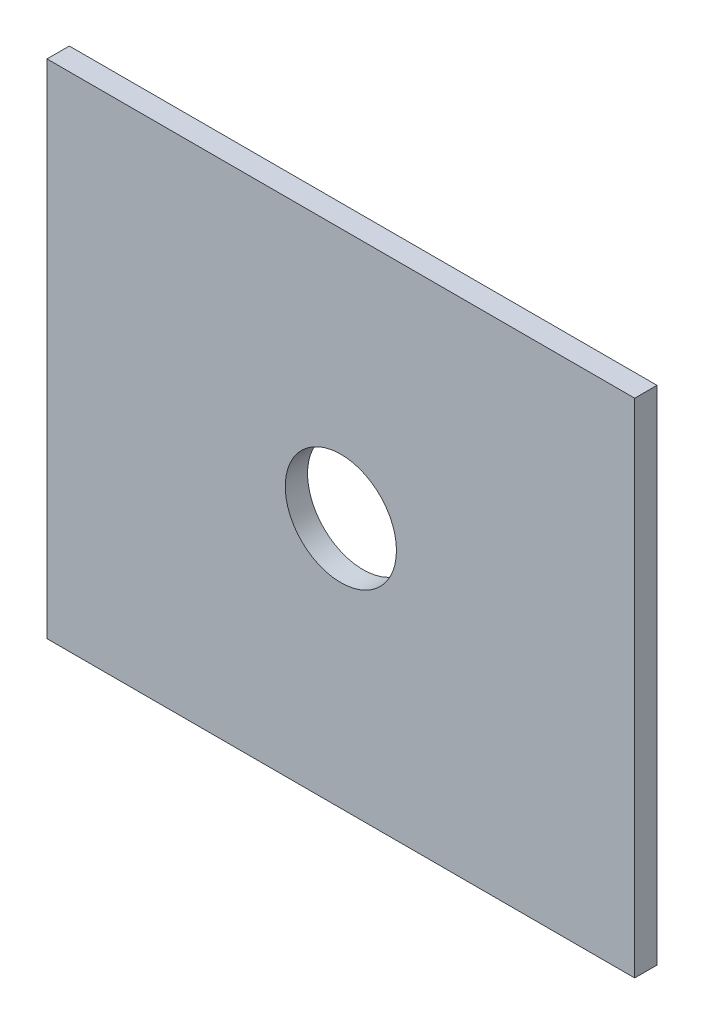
from build123d import *

# Parameters (mm, degrees)
ESQUISSE1_W        = 158
ESQUISSE1_H        = 135
ESQUISSE1_R        = 14.95
BOSS_EXTRU_1_DEPTH = 6


with BuildPart() as part:
    # Esquisse1 → Boss.-Extru.1 (new body)
    with BuildSketch(Plane.XY):
        with Locations((3.845226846, -4.939432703)):
            Rectangle(ESQUISSE1_W, ESQUISSE1_H)
        with Locations((3.845226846, -4.939432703)):
            Circle(ESQUISSE1_R, mode=Mode.SUBTRACT)
    extrude(amount=BOSS_EXTRU_1_DEPTH)


solid = part.part
